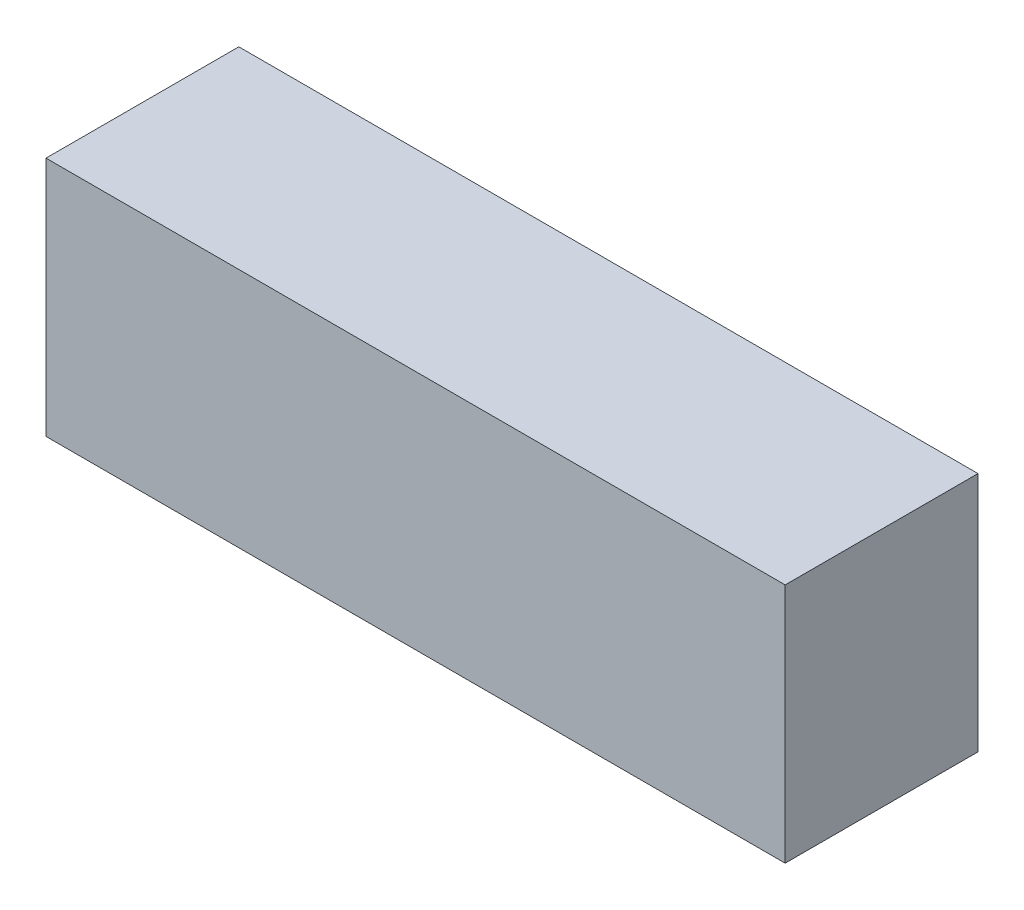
from build123d import *

# Parameters (mm, degrees)
SKETCH1_W           = 230
SKETCH1_H           = 60
BOSS_EXTRUDE1_DEPTH = 37.5


with BuildPart() as part:
    # Sketch1 → Boss-Extrude1 (new, symmetric)
    with BuildSketch(Plane(origin=(0, 0, 0), x_dir=(1, 0, 0), z_dir=(0, 1, 0))):
        Rectangle(SKETCH1_W, SKETCH1_H)
    extrude(amount=BOSS_EXTRUDE1_DEPTH, both=True)


solid = part.part
